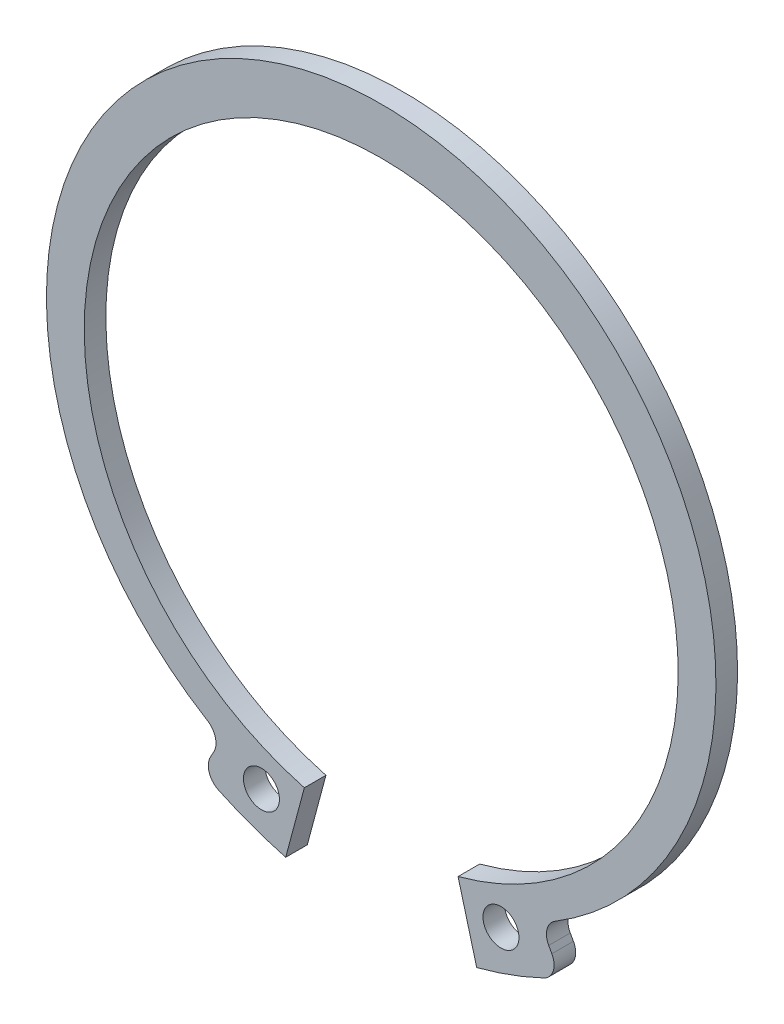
from build123d import *

# Parameters (mm, degrees)
ESQUISSE1_R          = 1
BASE_EXTRUSION_DEPTH = 1.2


with BuildPart() as part:
    # Esquisse1 → Base-Extrusion (new body)
    with BuildSketch(Plane.XY):
        with BuildLine():
            Line((9.305532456, -16.735226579), (9.480137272, -17.049238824))
            ThreePointArc((9.480137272, -17.049238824), (9.558785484, -17.839358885), (9.036827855, -18.43771955))
            ThreePointArc((9.036827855, -18.43771955), (7.203654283, -19.208090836), (5.305790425, -19.801479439))
            Line((5.305790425, -19.801479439), (4.270514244, -15.937776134))
            ThreePointArc((4.270514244, -15.937776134), (0, 16.5), (-4.270514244, -15.937776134))
            Line((-4.270514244, -15.937776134), (-5.305790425, -19.801479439))
            ThreePointArc((-5.305790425, -19.801479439), (-7.203654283, -19.208090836), (-9.036827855, -18.43771955))
            ThreePointArc((-9.036827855, -18.43771955), (-9.558785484, -17.839358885), (-9.480137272, -17.049238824))
            Line((-9.480137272, -17.049238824), (-9.305532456, -16.735226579))
            ThreePointArc((-9.305532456, -16.735226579), (-9.212761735, -15.993520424), (-9.660145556, -15.394703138))
            ThreePointArc((-9.660145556, -15.394703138), (0, 19.1), (9.660145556, -15.394703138))
            ThreePointArc((9.660145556, -15.394703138), (9.212761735, -15.993520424), (9.305532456, -16.735226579))
        make_face()
        with Locations((6.653671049, -17.187747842)):
            Circle(ESQUISSE1_R, mode=Mode.SUBTRACT)
        with Locations(Location((-6.653671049, -17.187747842, 0), (0, 0, 180))):
            Circle(ESQUISSE1_R, mode=Mode.SUBTRACT)
    extrude(amount=BASE_EXTRUSION_DEPTH)


solid = part.part
